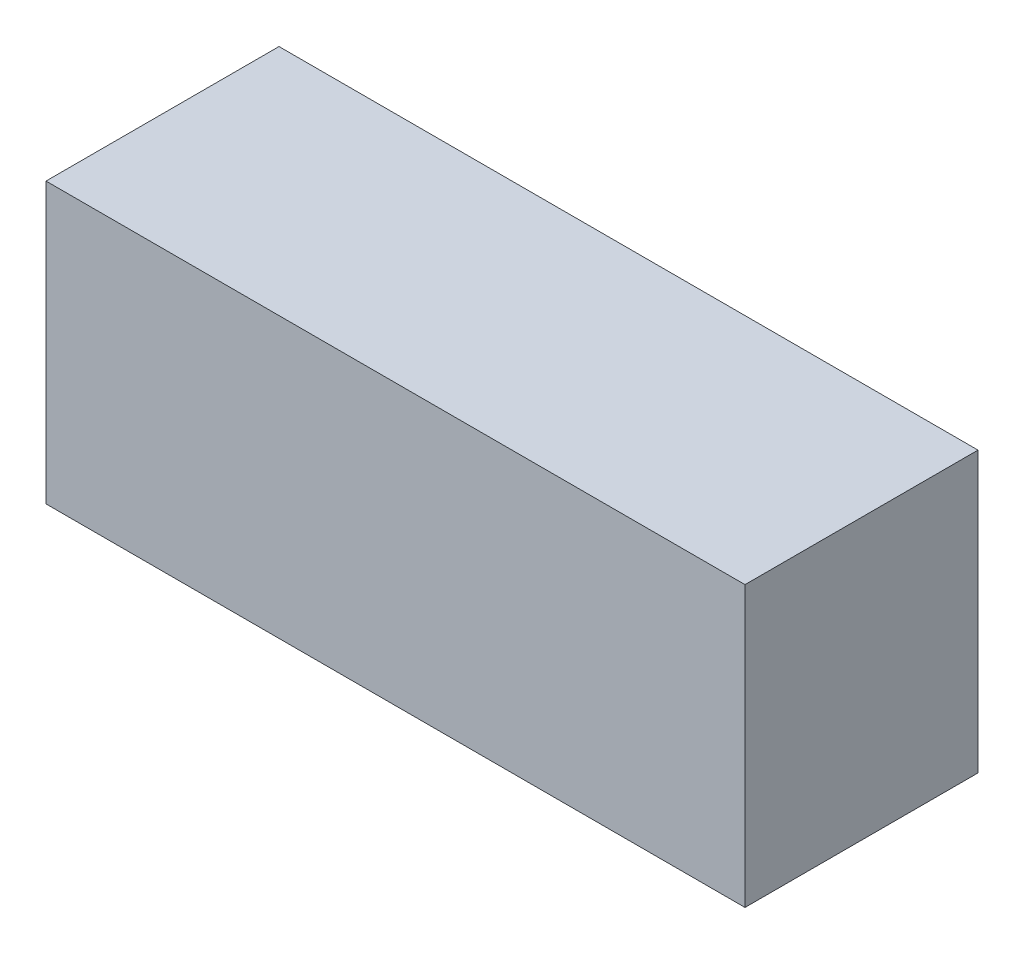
from build123d import *

# Parameters (mm, degrees)
ESQUISSE1_W          = 30
ESQUISSE1_H          = 12
BASE_EXTRUSION_DEPTH = 10


with BuildPart() as part:
    # Esquisse1 → Base-Extrusion (new body)
    with BuildSketch(Plane.XY):
        with Locations((15, -6)):
            Rectangle(ESQUISSE1_W, ESQUISSE1_H)
    extrude(amount=BASE_EXTRUSION_DEPTH)


solid = part.part
